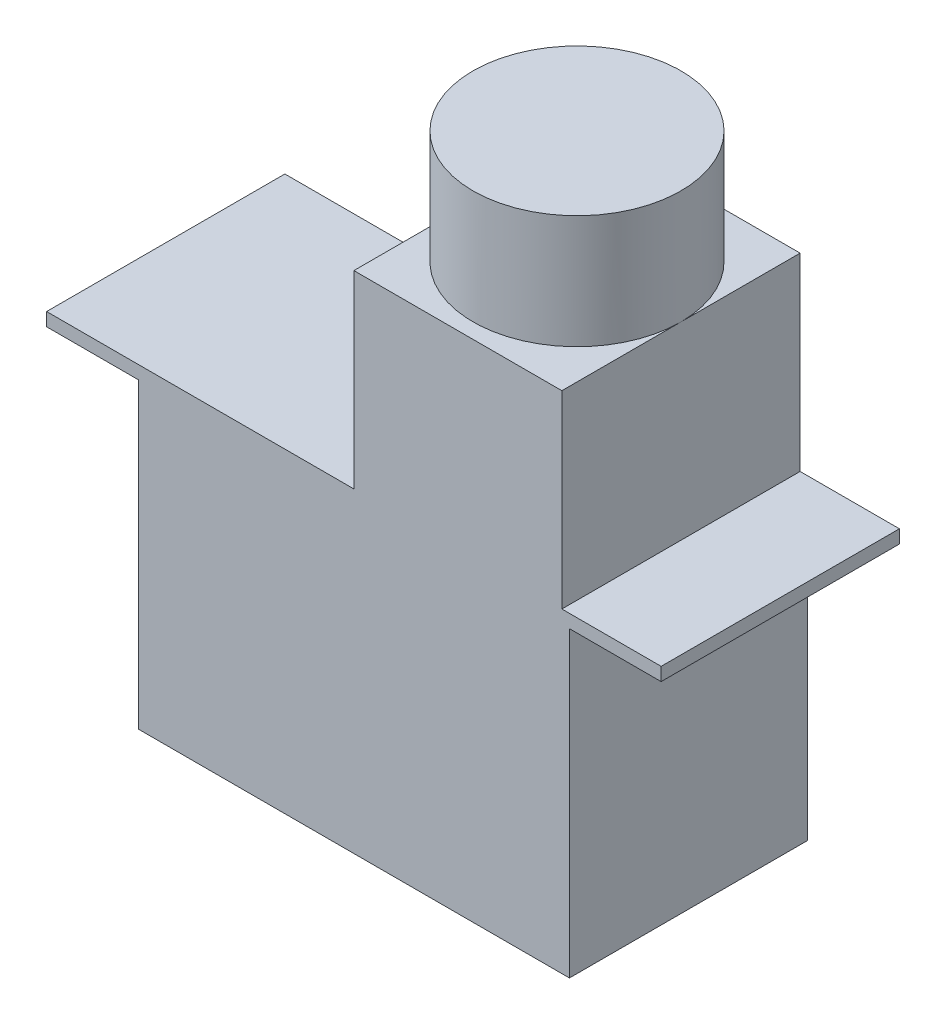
from build123d import *

# Parameters (mm, degrees)
SKETCH1_W           = 22.8
SKETCH1_H           = 12.6
BOSS_EXTRUDE1_DEPTH = 16
BOSS_EXTRUDE2_DEPTH = 0.7
SKETCH3_W           = 11
SKETCH3_H           = 12.6
BOSS_EXTRUDE3_DEPTH = 10
SKETCH4_R           = 5.5
BOSS_EXTRUDE4_DEPTH = 6


with BuildPart() as part:
    # Sketch1 → Boss-Extrude1 (new body)
    with BuildSketch(Plane(origin=(0, 0, 0), x_dir=(1, 0, 0), z_dir=(0, 1, 0))):
        with Locations((11.4, 6.3)):
            Rectangle(SKETCH1_W, SKETCH1_H)
    extrude(amount=BOSS_EXTRUDE1_DEPTH)

    # Sketch2 → Boss-Extrude2 (add)
    with BuildSketch(Plane(origin=(0, 16, 0), x_dir=(1, 0, 0), z_dir=(0, 1, 0))):
        Polygon((-4.85, 6.3), (-4.85, 12.6), (27.65, 12.6), (27.65, 0), (-4.85, 0), align=None)
    extrude(amount=BOSS_EXTRUDE2_DEPTH)

    # Sketch3 → Boss-Extrude3 (add)
    with BuildSketch(Plane(origin=(0, 16.7, 0), x_dir=(1, 0, 0), z_dir=(0, 1, 0))):
        with Locations((16.9, 6.3)):
            Rectangle(SKETCH3_W, SKETCH3_H)
    extrude(amount=BOSS_EXTRUDE3_DEPTH)

    # Sketch4 → Boss-Extrude4 (add)
    with BuildSketch(Plane(origin=(0, 26.7, 0), x_dir=(1, 0, 0), z_dir=(0, 1, 0))):
        with Locations(Location((16.9, 6.3, 0), (0, 0, 180))):
            Circle(SKETCH4_R)
    extrude(amount=BOSS_EXTRUDE4_DEPTH)


solid = part.part
